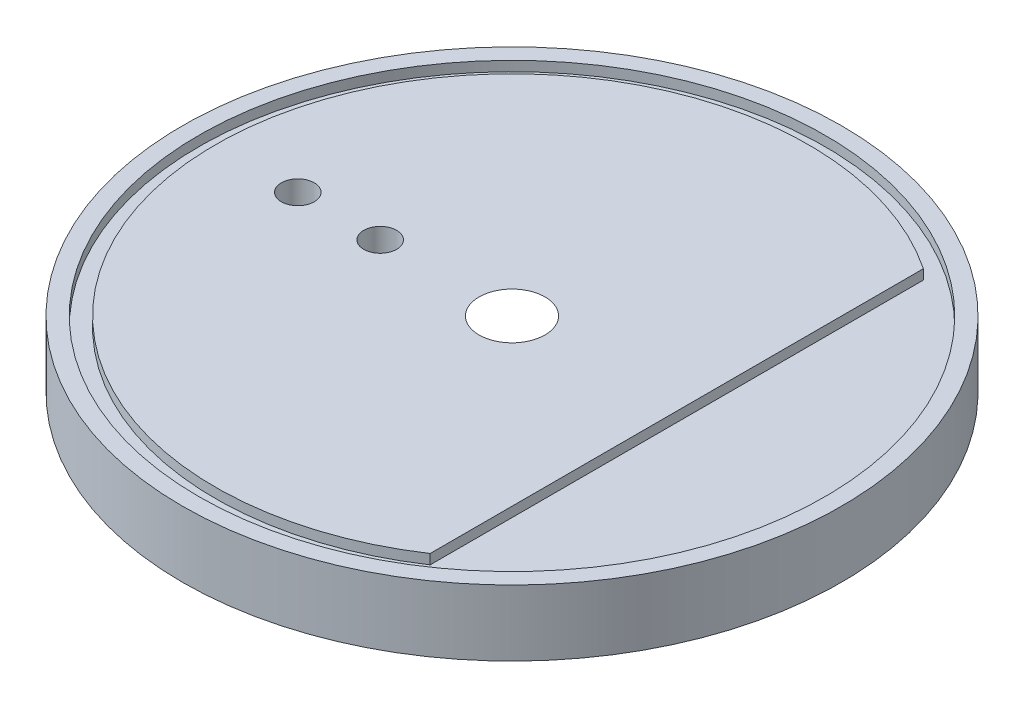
from build123d import *

# Parameters (mm, degrees)
SKETCH1_R          = 100
EXTRUDE1_DEPTH     = 20
SKETCH2_R          = 95
CUT_EXTRUDE1_DEPTH = 3
CUT_EXTRUDE2_START = -10
SKETCH3_R          = 90
CUT_EXTRUDE2_DEPTH = 10
SKETCH12_R         = 10
CUT_EXTRUDE3_DEPTH = 10
CUT_EXTRUDE3_DRAFT = 60
SKETCH14_R         = 5
CUT_EXTRUDE5_DEPTH = 10


with BuildPart() as part:
    # Sketch1 → Extrude1 (new body)
    with BuildSketch(Plane(origin=(0, 0, 0), x_dir=(1, 0, 0), z_dir=(0, 1, 0))):
        with Locations(Location((0, 0, 0), (0, 0, 270))):
            Circle(SKETCH1_R)
    extrude(amount=-EXTRUDE1_DEPTH)

    # Sketch2 → Cut-Extrude1 (cut)
    with BuildSketch(Plane(origin=(0, 0, 0), x_dir=(-1, 0, 0), z_dir=(0, 1, 0))):
        with Locations(Location((0, 0, 0), (0, 0, 90))):
            Circle(SKETCH2_R)
        with BuildLine():
            Line((-50, -74.833147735), (-50, 74.833147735))
            ThreePointArc((-50, 74.833147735), (90, 0), (-50, -74.833147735))
        make_face(mode=Mode.SUBTRACT)
    extrude(amount=-CUT_EXTRUDE1_DEPTH, mode=Mode.SUBTRACT)

    # Sketch3 → Cut-Extrude2 (cut)
    with BuildSketch(Plane.XZ.offset(20).offset(CUT_EXTRUDE2_START)):
        with Locations(Location((0, 0, 0), (0, 0, 270))):
            Circle(SKETCH3_R)
    extrude(amount=CUT_EXTRUDE2_DEPTH, mode=Mode.SUBTRACT)


with BuildPart() as cut_extrude3_tool:
    # Sketch12 → Cut-Extrude3 (with draft: the straight prism first)
    with BuildSketch(Plane(origin=(0, 0, 0), x_dir=(-1, 0, 0), z_dir=(0, 1, 0))):
        Circle(SKETCH12_R)
    extrude(amount=-CUT_EXTRUDE3_DEPTH)
    # Cut-Extrude3: the draft: its side faces are tilted about the plane it starts from
    cut_extrude3_sides = [cut_extrude3_tool.faces().sort_by_distance(p)[0] for p in [
        (10, -5, 0),
    ]]
    draft(cut_extrude3_sides, Plane(origin=(0, 0, 0), x_dir=(-1, 0, 0), z_dir=(0, 1, 0)), CUT_EXTRUDE3_DRAFT)


with BuildPart() as part_1:
    add(part.part)

    # Cut-Extrude3: cut by cut_extrude3_tool
    add(cut_extrude3_tool.part, mode=Mode.SUBTRACT)

    # Sketch14 → Cut-Extrude5 (cut)
    with BuildSketch(Plane(origin=(0, 0, 0), x_dir=(-1, 0, 0), z_dir=(0, 1, 0))):
        with Locations(Location((40, 0, 0), (0, 0, 90))):
            Circle(SKETCH14_R)
        with Locations(Location((65, 0, 0), (0, 0, 90))):
            Circle(SKETCH14_R)
    extrude(amount=-CUT_EXTRUDE5_DEPTH, mode=Mode.SUBTRACT)


solid = part_1.part
